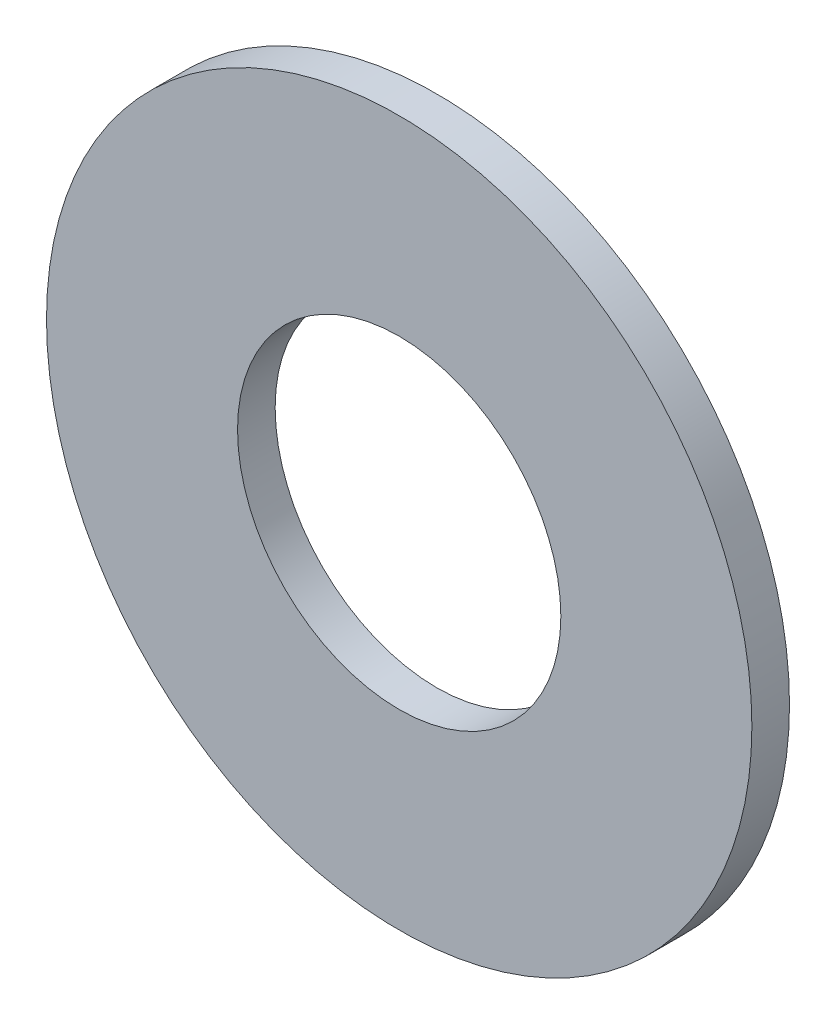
from build123d import *

# Parameters (mm, degrees)
SKETCH1_R      = 4.7625
SKETCH1_R_2    = 2.1828125
EXTRUDE1_DEPTH = 0.508


with BuildPart() as part:
    # Sketch1 → Extrude1 (new body)
    with BuildSketch(Plane.XY):
        Circle(SKETCH1_R)
        Circle(SKETCH1_R_2, mode=Mode.SUBTRACT)
    extrude(amount=-EXTRUDE1_DEPTH)


solid = part.part
